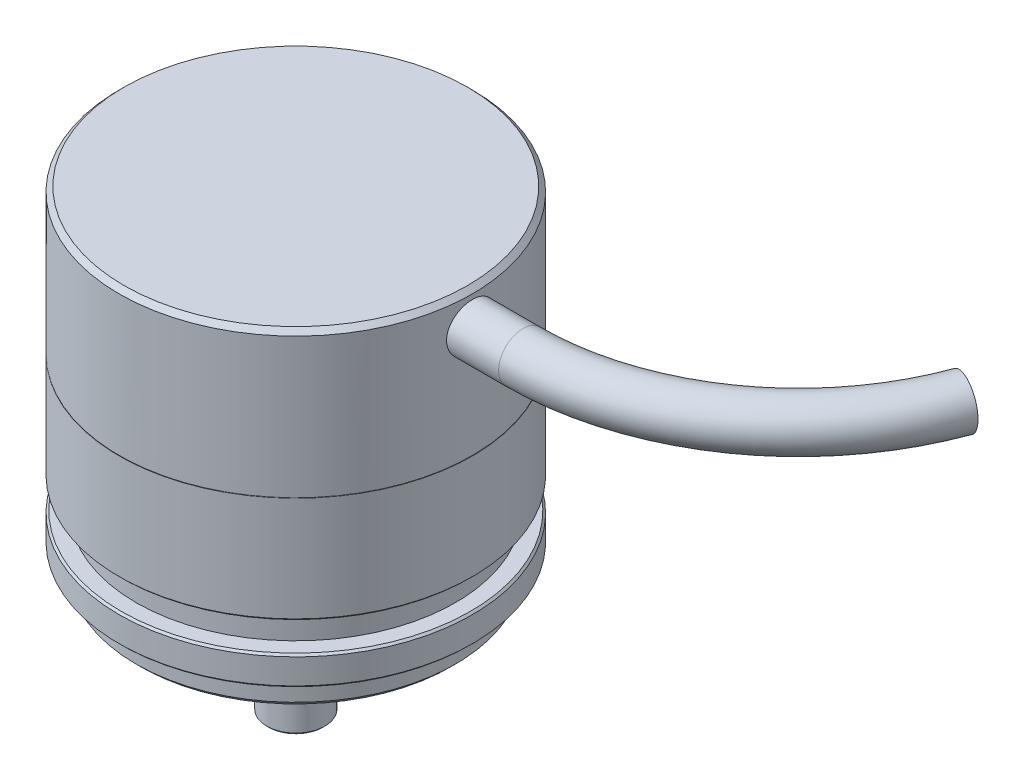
from build123d import *

# Parameters (mm, degrees)
CHAMFER1_SIZE       = 0.5
SKETCH2_R           = 2.5
BOSS_EXTRUDE1_DEPTH = 35
SKETCH3_R           = 2.5
BOSS_REVOLVE1_ANGLE = 70
SKETCH4_R           = 1.35
CUT_EXTRUDE1_DEPTH  = 6
CHAMFER2_SIZE       = 0.2


with BuildPart() as part:
    # Sketch1 → Base-Revolve (revolve)
    with BuildSketch(Plane.XY, mode=Mode.PRIVATE) as base_revolve_sk:
        Polygon((49.796323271, 36), (49.796323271, 21.05), (49.75, 21.05), (49.75, 21), (49.796323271, 21), (49.796323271, 10), (48.046323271, 10), (48.046323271, 7), (49.796323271, 7), (49.796323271, 4), (48.046323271, 4), (48.046323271, 1), (41.096323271, 1), (41.096323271, 1.1), (40.981385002, 1.1), (40.981385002, 1.014700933), (39.75, 1.014700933), (39.75, 1.1), (39.5, 1.1), (35.4, 1.1), (35.4, 1), (34.65, 1), (34.546323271, 1.1), (34.546323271, -11), (31.546323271, -11), (31.546323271, 36), align=None)
    revolve(base_revolve_sk.sketch.rotate(Axis((31.546323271, -11, 0), (0, 1, 0)), 90), axis=Axis((31.546323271, -11, 0), (0, 1, 0)))

    # Chamfer1
    chamfer1_edges = [part.edges().sort_by_distance(p)[0] for p in [
        (31.546323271, 36, 18.25),
        (31.546323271, 1, 16.5),
    ]]
    chamfer(chamfer1_edges, length=CHAMFER1_SIZE)

    # Sketch2 → Boss-Extrude1 (add)
    with BuildSketch(Plane(origin=(20, 0, 0), x_dir=(0, 0, -1), z_dir=(1, 0, 0))):
        with Locations(Location((0, 32.5, 0), (0, 0, 180))):
            Circle(SKETCH2_R)
    extrude(amount=BOSS_EXTRUDE1_DEPTH)

    # Sketch3 → Boss-Revolve1 (revolve)
    with BuildSketch(Plane(origin=(55, 0, 0), x_dir=(0, 0, -1), z_dir=(1, 0, 0))):
        with Locations(Location((0, 32.5, 0), (0, 0, 180))):
            Circle(SKETCH3_R)
    revolve(axis=Axis((55, 36.7, -28.5), (0, 1, 0)), revolution_arc=BOSS_REVOLVE1_ANGLE)

    # Sketch4 → Cut-Extrude1 (cut)
    with BuildSketch(Plane.XZ.offset(-1)):
        with Locations(Location((40.738711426, 9.192388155, 0), (0, 0, 270))):
            Circle(SKETCH4_R)
        with Locations(Location((40.738711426, -9.192388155, 0), (0, 0, 270))):
            Circle(SKETCH4_R)
        with Locations(Location((22.353935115, -9.192388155, 0), (0, 0, 270))):
            Circle(SKETCH4_R)
        with Locations(Location((22.353935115, 9.192388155, 0), (0, 0, 270))):
            Circle(SKETCH4_R)
    extrude(amount=-CUT_EXTRUDE1_DEPTH, mode=Mode.SUBTRACT)

    # Cut-Extrude2 cone 1 section (on through the dimple's axis) → Cut-Extrude2 (revolve, cut)
    with BuildSketch(Plane(origin=(40.738711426, 7, 9.192388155), x_dir=(0, 0, -1), z_dir=(1, 0, 0))):
        Polygon((0, 0), (1.35, 0), (0, 0.779422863), align=None)
    revolve(axis=Axis((40.738711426, 7, 9.192388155), (0, 1, 0)), mode=Mode.SUBTRACT)

    # Cut-Extrude2 cone 2 section (on through the dimple's axis) → Cut-Extrude2 cone 2 (revolve, cut)
    with BuildSketch(Plane(origin=(40.738711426, 7, -9.192388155), x_dir=(0, 0, -1), z_dir=(1, 0, 0))):
        Polygon((0, 0), (1.35, 0), (0, 0.779422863), align=None)
    revolve(axis=Axis((40.738711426, 7, -9.192388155), (0, 1, 0)), mode=Mode.SUBTRACT)

    # Cut-Extrude2 cone 3 section (on through the dimple's axis) → Cut-Extrude2 cone 3 (revolve, cut)
    with BuildSketch(Plane(origin=(22.353935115, 7, 9.192388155), x_dir=(0, 0, -1), z_dir=(1, 0, 0))):
        Polygon((0, 0), (1.35, 0), (0, 0.779422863), align=None)
    revolve(axis=Axis((22.353935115, 7, 9.192388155), (0, 1, 0)), mode=Mode.SUBTRACT)

    # Cut-Extrude2 cone 4 section (on through the dimple's axis) → Cut-Extrude2 cone 4 (revolve, cut)
    with BuildSketch(Plane(origin=(22.353935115, 7, -9.192388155), x_dir=(0, 0, -1), z_dir=(1, 0, 0))):
        Polygon((0, 0), (1.35, 0), (0, 0.779422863), align=None)
    revolve(axis=Axis((22.353935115, 7, -9.192388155), (0, 1, 0)), mode=Mode.SUBTRACT)

    # Chamfer2
    chamfer2_edges = [part.edges().sort_by_distance(p)[0] for p in [
        (31.546323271, 10, 18.25),
        (31.546323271, 7, 18.25),
        (31.546323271, 4, 18.25),
        (31.546323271, -11, 3),
        (40.738711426, 1, 10.542388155),
        (40.738711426, 1, -7.842388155),
        (22.353935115, 1, -7.842388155),
        (22.353935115, 1, 10.542388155),
    ]]
    chamfer(chamfer2_edges, length=CHAMFER2_SIZE)


solid = part.part
